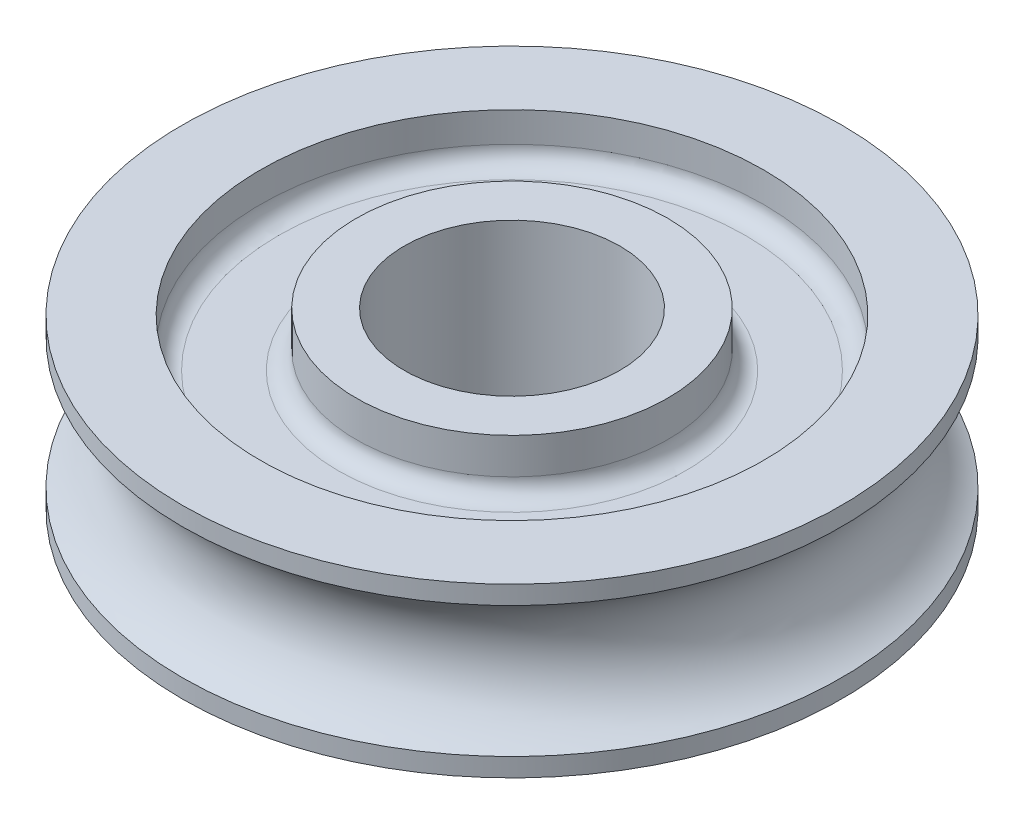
from build123d import *


with BuildPart() as part:
    # Esquisse10 → R_volution2 (revolve)
    with BuildSketch(Plane.XY, mode=Mode.PRIVATE) as r_volution2_sk:
        with BuildLine():
            Line((-18.00000266, -15), (-26.00000266, -15))
            Line((-26.00000266, -15), (-26.00000266, -9))
            ThreePointArc((-26.00000266, -9), (-26.878682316, -6.878679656), (-29.00000266, -6))
            Line((-29.00000266, -6), (-39.00000266, -6))
            ThreePointArc((-39.00000266, -6), (-41.121323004, -6.878679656), (-42.00000266, -9))
            Line((-42.00000266, -9), (-42.00000266, -14))
            Line((-42.00000266, -14), (-55, -14))
            Line((-55, -14), (-55, -10.908712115))
            ThreePointArc((-55, -10.908712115), (-48, 0), (-55, 10.908712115))
            Line((-55, 10.908712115), (-55, 14))
            Line((-55, 14), (-42.00000266, 14))
            Line((-42.00000266, 14), (-42.00000266, 9))
            ThreePointArc((-42.00000266, 9), (-41.121323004, 6.878679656), (-39.00000266, 6))
            Line((-39.00000266, 6), (-29.00000266, 6))
            ThreePointArc((-29.00000266, 6), (-26.878682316, 6.878679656), (-26.00000266, 9))
            Line((-26.00000266, 9), (-26.00000266, 15))
            Line((-26.00000266, 15), (-18.00000266, 15))
            Line((-18.00000266, 15), (-18.00000266, -15))
        make_face()
    revolve(r_volution2_sk.sketch.rotate(Axis((0, -31.903342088, 0), (0, 1, 0)), 270), axis=Axis((0, -31.903342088, 0), (0, 1, 0)))


solid = part.part
